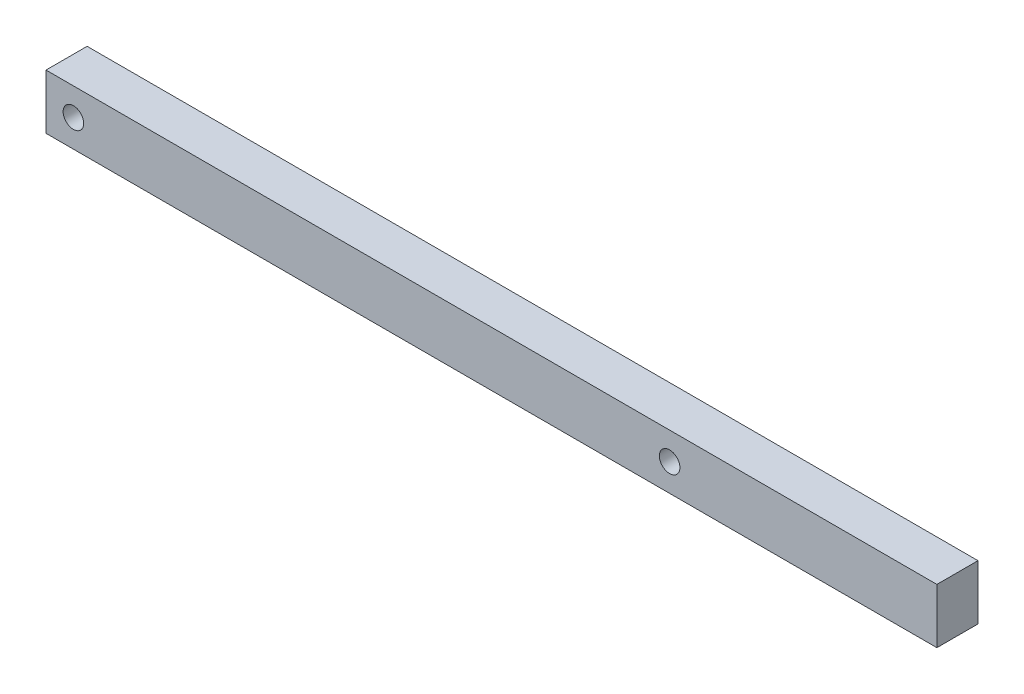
ISO-10303-21;
HEADER;
FILE_DESCRIPTION(('STEP AP214'),'2;1');
FILE_NAME('part.step','',(''),(''),'','','');
FILE_SCHEMA(('AUTOMOTIVE_DESIGN { 1 0 10303 214 1 1 1 1 }'));
ENDSEC;
DATA;
#1=APPLICATION_CONTEXT('core data for automotive mechanical design processes');
#2=APPLICATION_PROTOCOL_DEFINITION('international standard','automotive_design',2000,#1);
#3=PRODUCT_CONTEXT('',#1,'mechanical');
#4=PRODUCT('Part','Part','',(#3));
#5=PRODUCT_RELATED_PRODUCT_CATEGORY('part','',(#4));
#6=PRODUCT_DEFINITION_FORMATION('','',#4);
#7=PRODUCT_DEFINITION_CONTEXT('part definition',#1,'design');
#8=PRODUCT_DEFINITION('design','',#6,#7);
#9=PRODUCT_DEFINITION_SHAPE('','',#8);
#10=(LENGTH_UNIT() NAMED_UNIT(*) SI_UNIT(.MILLI.,.METRE.));
#11=(NAMED_UNIT(*) PLANE_ANGLE_UNIT() SI_UNIT($,.RADIAN.));
#12=(NAMED_UNIT(*) SI_UNIT($,.STERADIAN.) SOLID_ANGLE_UNIT());
#13=UNCERTAINTY_MEASURE_WITH_UNIT(LENGTH_MEASURE(1.E-05),#10,'distance_accuracy_value','');
#14=(GEOMETRIC_REPRESENTATION_CONTEXT(3) GLOBAL_UNCERTAINTY_ASSIGNED_CONTEXT((#13)) GLOBAL_UNIT_ASSIGNED_CONTEXT((#10,
#11,#12)) REPRESENTATION_CONTEXT('',''));
#15=CARTESIAN_POINT('',(0.,0.,0.));
#16=DIRECTION('',(0.,0.,1.));
#17=DIRECTION('',(1.,0.,0.));
#18=AXIS2_PLACEMENT_3D('',#15,#16,#17);
#19=CARTESIAN_POINT('',(-4.,-4.,6.));
#20=DIRECTION('',(0.,0.,1.));
#21=DIRECTION('',(1.,0.,0.));
#22=AXIS2_PLACEMENT_3D('',#19,#20,#21);
#23=PLANE('',#22);
#24=CARTESIAN_POINT('',(0.,0.,6.));
#25=DIRECTION('',(0.,0.,1.));
#26=DIRECTION('',(1.,0.,0.));
#27=AXIS2_PLACEMENT_3D('',#24,#25,#26);
#28=CIRCLE('',#27,1.5);
#29=CARTESIAN_POINT('',(1.5,0.,6.));
#30=VERTEX_POINT('',#29);
#31=EDGE_CURVE('E85',#30,#30,#28,.T.);
#32=ORIENTED_EDGE('',*,*,#31,.F.);
#33=EDGE_LOOP('',(#32));
#34=FACE_BOUND('',#33,.T.);
#35=DIRECTION('',(0.,-1.,0.));
#36=VECTOR('',#35,1.);
#37=CARTESIAN_POINT('',(-4.,3.99999999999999,6.));
#38=LINE('',#37,#36);
#39=CARTESIAN_POINT('',(-4.,3.99999999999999,6.));
#40=VERTEX_POINT('',#39);
#41=CARTESIAN_POINT('',(-4.,-4.,6.));
#42=VERTEX_POINT('',#41);
#43=EDGE_CURVE('E95',#40,#42,#38,.T.);
#44=ORIENTED_EDGE('',*,*,#43,.T.);
#45=DIRECTION('',(1.,0.,0.));
#46=VECTOR('',#45,1.);
#47=CARTESIAN_POINT('',(-4.,-4.,6.));
#48=LINE('',#47,#46);
#49=CARTESIAN_POINT('',(126.,-4.,6.));
#50=VERTEX_POINT('',#49);
#51=EDGE_CURVE('E80',#42,#50,#48,.T.);
#52=ORIENTED_EDGE('',*,*,#51,.T.);
#53=DIRECTION('',(0.,1.,0.));
#54=VECTOR('',#53,1.);
#55=CARTESIAN_POINT('',(126.,3.99999999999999,6.));
#56=LINE('',#55,#54);
#57=CARTESIAN_POINT('',(126.,3.99999999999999,6.));
#58=VERTEX_POINT('',#57);
#59=EDGE_CURVE('E46',#50,#58,#56,.T.);
#60=ORIENTED_EDGE('',*,*,#59,.T.);
#61=DIRECTION('',(-1.,0.,0.));
#62=VECTOR('',#61,1.);
#63=CARTESIAN_POINT('',(-4.,3.99999999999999,6.));
#64=LINE('',#63,#62);
#65=EDGE_CURVE('E41',#58,#40,#64,.T.);
#66=ORIENTED_EDGE('',*,*,#65,.T.);
#67=EDGE_LOOP('',(#44,#52,#60,#66));
#68=FACE_BOUND('',#67,.T.);
#69=CARTESIAN_POINT('',(87.,0.,6.));
#70=DIRECTION('',(0.,0.,1.));
#71=DIRECTION('',(1.,0.,0.));
#72=AXIS2_PLACEMENT_3D('',#69,#70,#71);
#73=CIRCLE('',#72,1.5);
#74=CARTESIAN_POINT('',(88.5,0.,6.));
#75=VERTEX_POINT('',#74);
#76=EDGE_CURVE('E113',#75,#75,#73,.T.);
#77=ORIENTED_EDGE('',*,*,#76,.F.);
#78=EDGE_LOOP('',(#77));
#79=FACE_BOUND('',#78,.T.);
#80=ADVANCED_FACE('F26',(#34,#68,#79),#23,.T.);
#81=CARTESIAN_POINT('',(-4.,-4.,0.));
#82=DIRECTION('',(0.,0.,1.));
#83=DIRECTION('',(1.,0.,0.));
#84=AXIS2_PLACEMENT_3D('',#81,#82,#83);
#85=PLANE('',#84);
#86=CARTESIAN_POINT('',(0.,0.,0.));
#87=DIRECTION('',(0.,0.,1.));
#88=DIRECTION('',(1.,0.,0.));
#89=AXIS2_PLACEMENT_3D('',#86,#87,#88);
#90=CIRCLE('',#89,1.5);
#91=CARTESIAN_POINT('',(1.5,0.,0.));
#92=VERTEX_POINT('',#91);
#93=EDGE_CURVE('E88',#92,#92,#90,.T.);
#94=ORIENTED_EDGE('',*,*,#93,.T.);
#95=EDGE_LOOP('',(#94));
#96=FACE_BOUND('',#95,.T.);
#97=DIRECTION('',(0.,-1.,0.));
#98=VECTOR('',#97,1.);
#99=CARTESIAN_POINT('',(-4.,3.99999999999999,0.));
#100=LINE('',#99,#98);
#101=CARTESIAN_POINT('',(-4.,3.99999999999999,0.));
#102=VERTEX_POINT('',#101);
#103=CARTESIAN_POINT('',(-4.,-4.,0.));
#104=VERTEX_POINT('',#103);
#105=EDGE_CURVE('E72',#102,#104,#100,.T.);
#106=ORIENTED_EDGE('',*,*,#105,.F.);
#107=DIRECTION('',(-1.,0.,0.));
#108=VECTOR('',#107,1.);
#109=CARTESIAN_POINT('',(-4.,3.99999999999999,0.));
#110=LINE('',#109,#108);
#111=CARTESIAN_POINT('',(126.,3.99999999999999,0.));
#112=VERTEX_POINT('',#111);
#113=EDGE_CURVE('E93',#112,#102,#110,.T.);
#114=ORIENTED_EDGE('',*,*,#113,.F.);
#115=DIRECTION('',(0.,1.,0.));
#116=VECTOR('',#115,1.);
#117=CARTESIAN_POINT('',(126.,3.99999999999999,0.));
#118=LINE('',#117,#116);
#119=CARTESIAN_POINT('',(126.,-4.,0.));
#120=VERTEX_POINT('',#119);
#121=EDGE_CURVE('E73',#120,#112,#118,.T.);
#122=ORIENTED_EDGE('',*,*,#121,.F.);
#123=DIRECTION('',(1.,0.,0.));
#124=VECTOR('',#123,1.);
#125=CARTESIAN_POINT('',(-4.,-4.,0.));
#126=LINE('',#125,#124);
#127=EDGE_CURVE('E67',#104,#120,#126,.T.);
#128=ORIENTED_EDGE('',*,*,#127,.F.);
#129=EDGE_LOOP('',(#106,#114,#122,#128));
#130=FACE_BOUND('',#129,.T.);
#131=CARTESIAN_POINT('',(87.,0.,0.));
#132=DIRECTION('',(0.,0.,1.));
#133=DIRECTION('',(1.,0.,0.));
#134=AXIS2_PLACEMENT_3D('',#131,#132,#133);
#135=CIRCLE('',#134,1.5);
#136=CARTESIAN_POINT('',(88.5,0.,0.));
#137=VERTEX_POINT('',#136);
#138=EDGE_CURVE('E115',#137,#137,#135,.T.);
#139=ORIENTED_EDGE('',*,*,#138,.T.);
#140=EDGE_LOOP('',(#139));
#141=FACE_BOUND('',#140,.T.);
#142=ADVANCED_FACE('F68',(#96,#130,#141),#85,.F.);
#143=CARTESIAN_POINT('',(-4.,3.99999999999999,6.));
#144=DIRECTION('',(1.,0.,0.));
#145=DIRECTION('',(0.,1.,0.));
#146=AXIS2_PLACEMENT_3D('',#143,#144,#145);
#147=PLANE('',#146);
#148=ORIENTED_EDGE('',*,*,#105,.T.);
#149=DIRECTION('',(0.,0.,-1.));
#150=VECTOR('',#149,1.);
#151=CARTESIAN_POINT('',(-4.,-4.,6.));
#152=LINE('',#151,#150);
#153=EDGE_CURVE('E11',#42,#104,#152,.T.);
#154=ORIENTED_EDGE('',*,*,#153,.F.);
#155=ORIENTED_EDGE('',*,*,#43,.F.);
#156=DIRECTION('',(0.,0.,-1.));
#157=VECTOR('',#156,1.);
#158=CARTESIAN_POINT('',(-4.,3.99999999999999,6.));
#159=LINE('',#158,#157);
#160=EDGE_CURVE('E84',#40,#102,#159,.T.);
#161=ORIENTED_EDGE('',*,*,#160,.T.);
#162=EDGE_LOOP('',(#148,#154,#155,#161));
#163=FACE_BOUND('',#162,.T.);
#164=ADVANCED_FACE('F28',(#163),#147,.F.);
#165=CARTESIAN_POINT('',(-4.,-4.,6.));
#166=DIRECTION('',(0.,1.,0.));
#167=DIRECTION('',(0.,0.,1.));
#168=AXIS2_PLACEMENT_3D('',#165,#166,#167);
#169=PLANE('',#168);
#170=ORIENTED_EDGE('',*,*,#127,.T.);
#171=DIRECTION('',(0.,0.,-1.));
#172=VECTOR('',#171,1.);
#173=CARTESIAN_POINT('',(126.,-4.,6.));
#174=LINE('',#173,#172);
#175=EDGE_CURVE('E34',#50,#120,#174,.T.);
#176=ORIENTED_EDGE('',*,*,#175,.F.);
#177=ORIENTED_EDGE('',*,*,#51,.F.);
#178=ORIENTED_EDGE('',*,*,#153,.T.);
#179=EDGE_LOOP('',(#170,#176,#177,#178));
#180=FACE_BOUND('',#179,.T.);
#181=ADVANCED_FACE('F79',(#180),#169,.F.);
#182=CARTESIAN_POINT('',(126.,3.99999999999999,6.));
#183=DIRECTION('',(-1.,0.,0.));
#184=DIRECTION('',(0.,0.,1.));
#185=AXIS2_PLACEMENT_3D('',#182,#183,#184);
#186=PLANE('',#185);
#187=ORIENTED_EDGE('',*,*,#121,.T.);
#188=DIRECTION('',(0.,0.,-1.));
#189=VECTOR('',#188,1.);
#190=CARTESIAN_POINT('',(126.,3.99999999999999,6.));
#191=LINE('',#190,#189);
#192=EDGE_CURVE('E101',#58,#112,#191,.T.);
#193=ORIENTED_EDGE('',*,*,#192,.F.);
#194=ORIENTED_EDGE('',*,*,#59,.F.);
#195=ORIENTED_EDGE('',*,*,#175,.T.);
#196=EDGE_LOOP('',(#187,#193,#194,#195));
#197=FACE_BOUND('',#196,.T.);
#198=ADVANCED_FACE('F104',(#197),#186,.F.);
#199=CARTESIAN_POINT('',(-4.,3.99999999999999,6.));
#200=DIRECTION('',(0.,-1.,0.));
#201=DIRECTION('',(0.,0.,-1.));
#202=AXIS2_PLACEMENT_3D('',#199,#200,#201);
#203=PLANE('',#202);
#204=ORIENTED_EDGE('',*,*,#113,.T.);
#205=ORIENTED_EDGE('',*,*,#160,.F.);
#206=ORIENTED_EDGE('',*,*,#65,.F.);
#207=ORIENTED_EDGE('',*,*,#192,.T.);
#208=EDGE_LOOP('',(#204,#205,#206,#207));
#209=FACE_BOUND('',#208,.T.);
#210=ADVANCED_FACE('F106',(#209),#203,.F.);
#211=CARTESIAN_POINT('',(0.,0.,6.));
#212=DIRECTION('',(0.,0.,-1.));
#213=DIRECTION('',(-1.,0.,0.));
#214=AXIS2_PLACEMENT_3D('',#211,#212,#213);
#215=CYLINDRICAL_SURFACE('',#214,1.5);
#216=ORIENTED_EDGE('',*,*,#31,.T.);
#217=EDGE_LOOP('',(#216));
#218=FACE_BOUND('',#217,.T.);
#219=ORIENTED_EDGE('',*,*,#93,.F.);
#220=EDGE_LOOP('',(#219));
#221=FACE_BOUND('',#220,.T.);
#222=ADVANCED_FACE('F124',(#218,#221),#215,.F.);
#223=CARTESIAN_POINT('',(87.,0.,6.));
#224=DIRECTION('',(0.,0.,-1.));
#225=DIRECTION('',(-1.,0.,0.));
#226=AXIS2_PLACEMENT_3D('',#223,#224,#225);
#227=CYLINDRICAL_SURFACE('',#226,1.5);
#228=ORIENTED_EDGE('',*,*,#76,.T.);
#229=EDGE_LOOP('',(#228));
#230=FACE_BOUND('',#229,.T.);
#231=ORIENTED_EDGE('',*,*,#138,.F.);
#232=EDGE_LOOP('',(#231));
#233=FACE_BOUND('',#232,.T.);
#234=ADVANCED_FACE('F122',(#230,#233),#227,.F.);
#235=CLOSED_SHELL('',(#80,#142,#164,#181,#198,#210,#222,#234));
#236=MANIFOLD_SOLID_BREP('B2',#235);
#237=ADVANCED_BREP_SHAPE_REPRESENTATION('',(#18,#236),#14);
#238=SHAPE_DEFINITION_REPRESENTATION(#9,#237);
ENDSEC;
END-ISO-10303-21;
